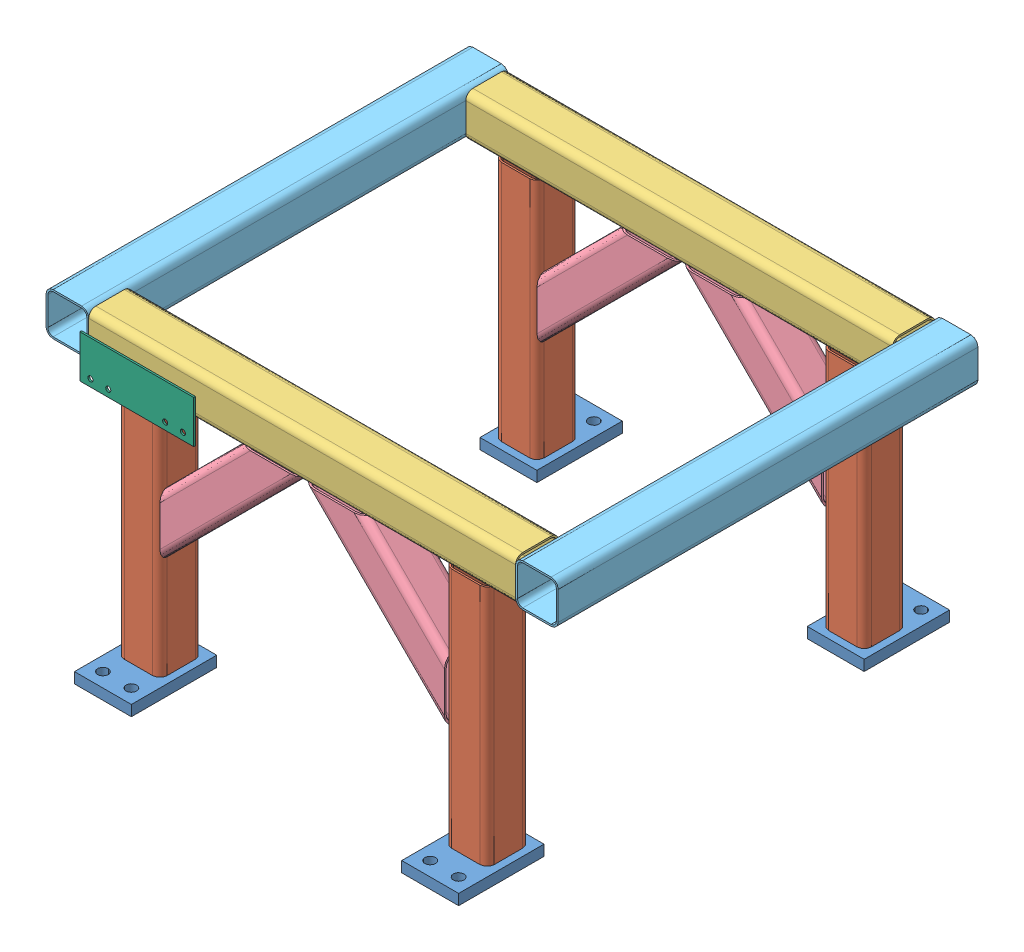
SolidWorks assembly conveyor_frame.SLDASM, configuration Default (file format 11000). Lengths in mm.
Overall size (914.4 527.05 876.3).
17 component instances, 6 part files, 48 mates.
Components (placement in the parent):
- supp_base_pl-1: supp_base_pl.SLDPRT [Default] at origin size (101.6 19.05 152.4)
- supp_ts3x3_vert-1: supp_ts3x3_vert.SLDPRT [Default] at (50.8 450.85 -101.6) x (1 0 0) z (0 -1 0) size (76.2 76.2 431.8)
- supp_ts3x3_hor30-1: supp_ts3x3_hor30.SLDPRT [Default] at (723.9 488.95 -101.6) x (0 0 -1) z (-1 0 0) size (76.2 76.2 762)
- supp_ts3x3_vert-2: supp_ts3x3_vert.SLDPRT [Default] at (635 19.05 -101.6) x (1 0 0) z (0 1 0) size (76.2 76.2 431.8)
- supp_base_pl-2: supp_base_pl.SLDPRT [Default] at (584.2 0 0) size (101.6 19.05 152.4)
- supp_ts3x3_ang45-1: supp_ts3x3_ang45.SLDPRT [Default] at (313.4064 480.9658 -101.6) x (0 0 1) z (-0.707107 -0.707107 0) size (76.2 76.2 355.6)
- supp_ts3x3_ang45-2: supp_ts3x3_ang45.SLDPRT [Default] at (372.3936 477.7908 -101.6) x (0 0 -1) z (0.707107 -0.707107 0) size (76.2 76.2 355.6)
- supp_ts3x3_hor295-1: supp_ts3x3_hor295.SLDPRT [Default] at (-76.2 488.95 -63.5) x (-1 0 0) z (0 0 -1) size (76.2 76.2 749.3)
- supp_ts3x3_hor295-2: supp_ts3x3_hor295.SLDPRT [Default] at (762 488.95 -812.8) size (76.2 76.2 749.3)
- supp_ts3x3_hor30-2: supp_ts3x3_hor30.SLDPRT [Default] at (723.9 488.95 -774.7) x (0 0 1) z (-1 0 0) size (76.2 76.2 762)
- supp_ts3x3_vert-3: supp_ts3x3_vert.SLDPRT [Default] at (635 450.85 -774.7) x (1 0 0) z (0 -1 0) size (76.2 76.2 431.8)
- supp_ts3x3_vert-4: supp_ts3x3_vert.SLDPRT [Default] at (50.8 19.05 -774.7) x (0 0 -1) z (0 1 0) size (76.2 76.2 431.8)
- supp_ts3x3_ang45-3: supp_ts3x3_ang45.SLDPRT [Default] at (372.3936 477.7908 -774.7) x (0 0 -1) z (0.707107 -0.707107 0) size (76.2 76.2 355.6)
- supp_ts3x3_ang45-4: supp_ts3x3_ang45.SLDPRT [Default] at (61.9592 226.3436 -774.7) x (0 0 -1) z (0.707107 0.707107 0) size (76.2 76.2 355.6)
- supp_base_pl-3: supp_base_pl.SLDPRT [Default] at (685.8 0 -876.3) x (-1 0 0) z (0 0 -1) size (101.6 19.05 152.4)
- supp_base_pl-4: supp_base_pl.SLDPRT [Default] at (101.6 0 -876.3) x (-1 0 0) z (0 0 -1) size (101.6 19.05 152.4)
- Mtg_Pl-1: Mtg_Pl.sldprt [Default] at (152.4 488.95 -63.5) x (-1 0 0) z (0 0 1) size (203.2 76.2 3.17)
Mates (geometry in assembly coordinates):
- Coincident1: coincident: plane of supp_base_pl-1 through (0 19.05 -152.4) normal (0 1 0); plane of supp_ts3x3_vert-1 through (76.2 19.05 -76.2) normal (0 -1 0)
- Distance1: distance = 12.7 mm: plane of supp_base_pl-1 through (101.6 19.05 -152.4) normal (1 0 0); plane of supp_ts3x3_vert-1 through (88.9 19.05 -127) normal (1 0 0)
- Distance2: distance = 12.7 mm: plane of supp_base_pl-1 through (101.6 19.05 -152.4) normal (0 0 -1); plane of supp_ts3x3_vert-1 through (76.2 19.05 -139.7) normal (0 0 -1)
- Coincident2: coincident: plane of supp_ts3x3_vert-1 through (76.2 450.85 -76.2) normal (0 1 0); plane of supp_ts3x3_hor30-1 through (-38.1 450.85 -76.2) normal (0 -1 0)
- Coincident3: coincident: plane of supp_ts3x3_vert-1 through (25.4 19.05 -63.5) normal (0 0 1); plane of supp_ts3x3_hor30-1 through (-38.1 463.55 -63.5) normal (0 0 1)
- Coincident5: coincident: plane of supp_ts3x3_hor30-1 through (-38.1 450.85 -76.2) normal (0 -1 0); plane of supp_ts3x3_vert-2 through (660.4 450.85 -127) normal (0 1 0)
- Coincident6: coincident: plane of supp_ts3x3_hor30-1 through (-38.1 463.55 -63.5) normal (0 0 1); plane of supp_ts3x3_vert-2 through (660.4 450.85 -63.5) normal (0 0 1)
- Coincident8: coincident: plane of supp_ts3x3_vert-2 through (660.4 19.05 -127) normal (0 -1 0); plane of supp_base_pl-2 through (584.2 19.05 -152.4) normal (0 1 0)
- Distance3: distance = 12.7 mm: plane of supp_ts3x3_vert-2 through (673.1 450.85 -76.2) normal (1 0 0); plane of supp_base_pl-2 through (685.8 19.05 -152.4) normal (1 0 0)
- Distance4: distance = 12.7 mm: plane of supp_ts3x3_vert-2 through (609.6 450.85 -139.7) normal (0 0 -1); plane of supp_base_pl-2 through (685.8 19.05 -152.4) normal (0 0 -1)
- Coincident9: coincident: plane of supp_ts3x3_vert-1 through (88.9 19.05 -127) normal (1 0 0); plane of supp_ts3x3_ang45-1 through (88.9 202.5778 -63.5) normal (-1 0 0)
- Coincident10: coincident: plane of supp_ts3x3_hor30-1 through (-38.1 463.55 -63.5) normal (0 0 1); plane of supp_ts3x3_ang45-1 through (79.9197 211.5581 -63.5) normal (0 0 1)
- Coincident11: coincident: plane of supp_ts3x3_hor30-1 through (-38.1 454.025 -76.2) normal (0 1 0); plane of supp_ts3x3_ang45-1 through (340.3472 454.025 -63.5) normal (0 1 0)
- Coincident13: coincident: plane of supp_ts3x3_vert-2 through (596.9 450.85 -127) normal (-1 0 0); plane of supp_ts3x3_ang45-2 through (596.9 199.4028 -139.7) normal (1 0 0)
- Coincident14: coincident: plane of supp_ts3x3_hor30-1 through (-38.1 450.85 -76.2) normal (0 -1 0); plane of supp_ts3x3_ang45-2 through (345.4528 450.85 -139.7) normal (0 1 0)
- Coincident15: coincident: plane of supp_ts3x3_hor30-1 through (-38.1 463.55 -63.5) normal (0 0 1); plane of supp_ts3x3_ang45-2 through (641.8013 244.3041 -63.5) normal (0 0 1)
- Coincident17: coincident: plane of supp_ts3x3_hor30-1 through (-38.1 527.05 -127) normal (0 1 0); plane of supp_ts3x3_hor295-1 through (-50.8 527.05 -812.8) normal (0 1 0)
- Coincident26: coincident: plane of supp_ts3x3_hor30-1 through (-38.1 463.55 -127) normal (-1 0 0); plane of supp_ts3x3_hor295-1 through (-38.1 514.35 -812.8) normal (1 0 0)
- Coincident27: coincident: plane of supp_ts3x3_hor30-1 through (-38.1 463.55 -63.5) normal (0 0 1); plane of supp_ts3x3_hor295-1 through (-101.6 514.35 -63.5) normal (0 0 1)
- Coincident28: coincident: plane of supp_ts3x3_hor30-1 through (723.9 463.55 -127) normal (1 0 0); plane of supp_ts3x3_hor295-2 through (723.9 514.35 -63.5) normal (-1 0 0)
- Coincident29: coincident: plane of supp_ts3x3_hor30-1 through (-38.1 463.55 -63.5) normal (0 0 1); plane of supp_ts3x3_hor295-2 through (787.4 514.35 -63.5) normal (0 0 1)
- Coincident31: coincident: plane of supp_ts3x3_hor30-1 through (-38.1 527.05 -127) normal (0 1 0); plane of supp_ts3x3_hor295-2 through (736.6 527.05 -63.5) normal (0 1 0)
- Distance5: distance = 127 mm: plane of supp_ts3x3_vert-1 through (88.9 19.05 -127) normal (1 0 0); plane of supp_ts3x3_hor295-1 through (-38.1 514.35 -812.8) normal (1 0 0)
- Distance6: distance = 127 mm: plane of supp_ts3x3_vert-2 through (596.9 450.85 -127) normal (-1 0 0); plane of supp_ts3x3_hor295-2 through (723.9 514.35 -63.5) normal (-1 0 0)
- Coincident32: coincident: plane of supp_ts3x3_hor295-1 through (-38.1 514.35 -812.8) normal (1 0 0); plane of supp_ts3x3_hor30-2 through (-38.1 514.35 -749.3) normal (-1 0 0)
- Coincident33: coincident: plane of supp_ts3x3_hor295-1 through (-101.6 514.35 -812.8) normal (0 0 -1); plane of supp_ts3x3_hor30-2 through (-38.1 514.35 -812.8) normal (0 0 -1)
- Coincident34: coincident: plane of supp_ts3x3_hor295-1 through (-50.8 527.05 -812.8) normal (0 1 0); plane of supp_ts3x3_hor30-2 through (-38.1 527.05 -800.1) normal (0 1 0)
- Coincident36: coincident: plane of supp_ts3x3_hor30-2 through (-38.1 450.85 -749.3) normal (0 -1 0); plane of supp_ts3x3_vert-3 through (660.4 450.85 -749.3) normal (0 1 0)
- Coincident37: coincident: plane of supp_ts3x3_vert-2 through (673.1 450.85 -76.2) normal (1 0 0); plane of supp_ts3x3_vert-3 through (673.1 19.05 -800.1) normal (1 0 0)
- Coincident38: coincident: plane of supp_ts3x3_hor30-2 through (-38.1 514.35 -812.8) normal (0 0 -1); plane of supp_ts3x3_vert-3 through (660.4 19.05 -812.8) normal (0 0 -1)
- Coincident40: coincident: plane of supp_ts3x3_hor30-2 through (-38.1 514.35 -812.8) normal (0 0 -1); plane of supp_ts3x3_vert-4 through (76.2 450.85 -812.8) normal (0 0 -1)
- Coincident41: coincident: plane of supp_ts3x3_hor30-2 through (-38.1 450.85 -749.3) normal (0 -1 0); plane of supp_ts3x3_vert-4 through (25.4 450.85 -800.1) normal (0 1 0)
- Coincident42: coincident: plane of supp_ts3x3_vert-1 through (88.9 19.05 -127) normal (1 0 0); plane of supp_ts3x3_vert-4 through (88.9 450.85 -800.1) normal (1 0 0)
- Coincident43: coincident: plane of supp_ts3x3_hor30-2 through (-38.1 450.85 -749.3) normal (0 -1 0); plane of supp_ts3x3_ang45-3 through (345.4528 450.85 -812.8) normal (0 1 0)
- Coincident44: coincident: plane of supp_ts3x3_vert-3 through (596.9 19.05 -749.3) normal (-1 0 0); plane of supp_ts3x3_ang45-3 through (596.9 199.4028 -812.8) normal (1 0 0)
- Coincident45: coincident: plane of supp_ts3x3_vert-3 through (660.4 19.05 -812.8) normal (0 0 -1); plane of supp_ts3x3_ang45-3 through (605.8803 208.3831 -812.8) normal (0 0 -1)
- Coincident46: coincident: plane of supp_ts3x3_hor30-2 through (-38.1 450.85 -749.3) normal (0 -1 0); plane of supp_ts3x3_ang45-4 through (340.3472 450.85 -812.8) normal (0 1 0)
- Coincident47: coincident: plane of supp_ts3x3_vert-4 through (88.9 450.85 -800.1) normal (1 0 0); plane of supp_ts3x3_ang45-4 through (88.9 199.4028 -812.8) normal (-1 0 0)
- Coincident48: coincident: plane of supp_ts3x3_hor30-2 through (-38.1 514.35 -812.8) normal (0 0 -1); plane of supp_ts3x3_ang45-4 through (331.3669 459.8303 -812.8) normal (0 0 -1)
- Distance7: distance = 12.7 mm: plane of supp_ts3x3_vert-3 through (609.6 19.05 -736.6) normal (0 0 1); plane of supp_base_pl-3 through (584.2 19.05 -723.9) normal (0 0 1)
- Coincident49: coincident: plane of supp_ts3x3_vert-3 through (660.4 19.05 -749.3) normal (0 -1 0); plane of supp_base_pl-3 through (685.8 19.05 -723.9) normal (0 1 0)
- Distance8: distance = 12.7 mm: plane of supp_ts3x3_vert-3 through (673.1 19.05 -800.1) normal (1 0 0); plane of supp_base_pl-3 through (685.8 19.05 -876.3) normal (1 0 0)
- Coincident50: coincident: plane of supp_ts3x3_vert-4 through (25.4 19.05 -800.1) normal (0 -1 0); plane of supp_base_pl-4 through (101.6 19.05 -723.9) normal (0 1 0)
- Distance9: distance = 12.7 mm: plane of supp_ts3x3_vert-4 through (25.4 450.85 -736.6) normal (0 0 1); plane of supp_base_pl-4 through (0 19.05 -723.9) normal (0 0 1)
- Distance10: distance = 12.7 mm: plane of supp_ts3x3_vert-4 through (88.9 450.85 -800.1) normal (1 0 0); plane of supp_base_pl-4 through (101.6 19.05 -876.3) normal (1 0 0)
- Coincident51: coincident: plane of supp_ts3x3_hor30-1 through (-38.1 463.55 -63.5) normal (0 0 1); plane of Mtg_Pl-1 through (152.4 488.95 -63.5) normal (0 0 -1)
- Distance11: distance = 38.1 mm: plane of supp_ts3x3_hor30-1 through (-38.1 527.05 -127) normal (0 1 0); plane of Mtg_Pl-1 through (-50.8 488.95 -60.325) normal (0 1 0)
- Distance12: distance = 63.5 mm: plane of Mtg_Pl-1 through (-50.8 488.95 -60.325) normal (-1 0 0); plane of supp_ts3x3_hor295-1 through (-114.3 463.55 -812.8) normal (-1 0 0)
